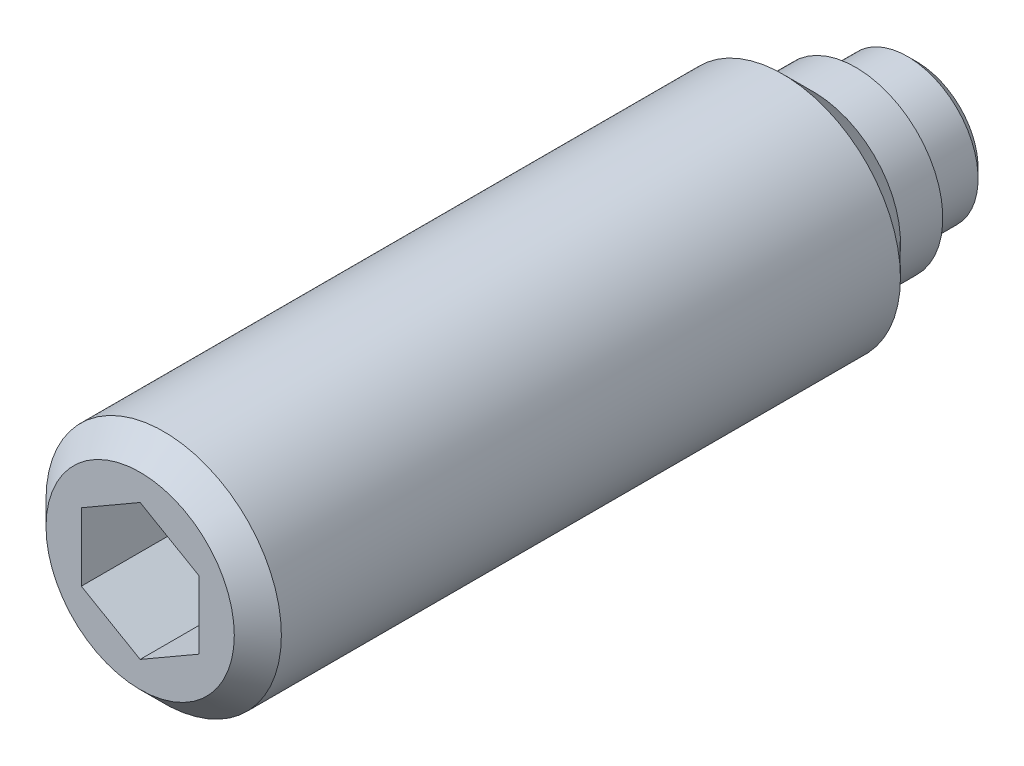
ISO-10303-21;
HEADER;
FILE_DESCRIPTION(('STEP AP214'),'2;1');
FILE_NAME('part.step','',(''),(''),'','','');
FILE_SCHEMA(('AUTOMOTIVE_DESIGN { 1 0 10303 214 1 1 1 1 }'));
ENDSEC;
DATA;
#1=APPLICATION_CONTEXT('core data for automotive mechanical design processes');
#2=APPLICATION_PROTOCOL_DEFINITION('international standard','automotive_design',2000,#1);
#3=PRODUCT_CONTEXT('',#1,'mechanical');
#4=PRODUCT('Part','Part','',(#3));
#5=PRODUCT_RELATED_PRODUCT_CATEGORY('part','',(#4));
#6=PRODUCT_DEFINITION_FORMATION('','',#4);
#7=PRODUCT_DEFINITION_CONTEXT('part definition',#1,'design');
#8=PRODUCT_DEFINITION('design','',#6,#7);
#9=PRODUCT_DEFINITION_SHAPE('','',#8);
#10=(LENGTH_UNIT() NAMED_UNIT(*) SI_UNIT(.MILLI.,.METRE.));
#11=(NAMED_UNIT(*) PLANE_ANGLE_UNIT() SI_UNIT($,.RADIAN.));
#12=(NAMED_UNIT(*) SI_UNIT($,.STERADIAN.) SOLID_ANGLE_UNIT());
#13=UNCERTAINTY_MEASURE_WITH_UNIT(LENGTH_MEASURE(1.E-05),#10,'distance_accuracy_value','');
#14=(GEOMETRIC_REPRESENTATION_CONTEXT(3) GLOBAL_UNCERTAINTY_ASSIGNED_CONTEXT((#13)) GLOBAL_UNIT_ASSIGNED_CONTEXT((#10,
#11,#12)) REPRESENTATION_CONTEXT('',''));
#15=CARTESIAN_POINT('',(0.,0.,0.));
#16=DIRECTION('',(0.,0.,1.));
#17=DIRECTION('',(1.,0.,0.));
#18=AXIS2_PLACEMENT_3D('',#15,#16,#17);
#19=CARTESIAN_POINT('',(0.,1.85,1.3));
#20=DIRECTION('',(0.,0.,1.));
#21=DIRECTION('',(1.,0.,0.));
#22=AXIS2_PLACEMENT_3D('',#19,#20,#21);
#23=PLANE('',#22);
#24=CARTESIAN_POINT('',(0.,0.,1.3));
#25=DIRECTION('',(0.,0.,-1.));
#26=DIRECTION('',(-1.,0.,0.));
#27=AXIS2_PLACEMENT_3D('',#24,#25,#26);
#28=CIRCLE('',#27,1.5);
#29=CARTESIAN_POINT('',(-1.5,0.,1.3));
#30=VERTEX_POINT('',#29);
#31=EDGE_CURVE('E130',#30,#30,#28,.T.);
#32=ORIENTED_EDGE('',*,*,#31,.F.);
#33=EDGE_LOOP('',(#32));
#34=FACE_BOUND('',#33,.T.);
#35=CARTESIAN_POINT('',(0.,0.,1.3));
#36=DIRECTION('',(0.,0.,-1.));
#37=DIRECTION('',(-1.,0.,0.));
#38=AXIS2_PLACEMENT_3D('',#35,#36,#37);
#39=CIRCLE('',#38,1.85);
#40=CARTESIAN_POINT('',(-1.85,0.,1.3));
#41=VERTEX_POINT('',#40);
#42=EDGE_CURVE('E133',#41,#41,#39,.T.);
#43=ORIENTED_EDGE('',*,*,#42,.T.);
#44=EDGE_LOOP('',(#43));
#45=FACE_BOUND('',#44,.T.);
#46=ADVANCED_FACE('F14',(#34,#45),#23,.F.);
#47=CARTESIAN_POINT('',(0.,0.,1.3));
#48=DIRECTION('',(0.,0.,-1.));
#49=DIRECTION('',(-1.,0.,0.));
#50=AXIS2_PLACEMENT_3D('',#47,#48,#49);
#51=CYLINDRICAL_SURFACE('',#50,2.5);
#52=CARTESIAN_POINT('',(0.,0.,16.));
#53=DIRECTION('',(0.,0.,1.));
#54=DIRECTION('',(1.,0.,0.));
#55=AXIS2_PLACEMENT_3D('',#52,#53,#54);
#56=CIRCLE('',#55,2.5);
#57=CARTESIAN_POINT('',(2.5,0.,16.));
#58=VERTEX_POINT('',#57);
#59=EDGE_CURVE('E9',#58,#58,#56,.F.);
#60=ORIENTED_EDGE('',*,*,#59,.T.);
#61=EDGE_LOOP('',(#60));
#62=FACE_BOUND('',#61,.T.);
#63=CARTESIAN_POINT('',(0.,0.,2.85));
#64=DIRECTION('',(0.,0.,-1.));
#65=DIRECTION('',(-1.,0.,0.));
#66=AXIS2_PLACEMENT_3D('',#63,#64,#65);
#67=CIRCLE('',#66,2.5);
#68=CARTESIAN_POINT('',(-2.5,0.,2.85));
#69=VERTEX_POINT('',#68);
#70=EDGE_CURVE('E139',#69,#69,#67,.T.);
#71=ORIENTED_EDGE('',*,*,#70,.F.);
#72=EDGE_LOOP('',(#71));
#73=FACE_BOUND('',#72,.T.);
#74=ADVANCED_FACE('F157',(#62,#73),#51,.T.);
#75=CARTESIAN_POINT('',(0.,0.,2.85));
#76=DIRECTION('',(0.,0.,1.));
#77=DIRECTION('',(1.,0.,0.));
#78=AXIS2_PLACEMENT_3D('',#75,#76,#77);
#79=CONICAL_SURFACE('',#78,2.5,0.785398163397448);
#80=CARTESIAN_POINT('',(0.,0.,2.2));
#81=DIRECTION('',(0.,0.,-1.));
#82=DIRECTION('',(-1.,0.,0.));
#83=AXIS2_PLACEMENT_3D('',#80,#81,#82);
#84=CIRCLE('',#83,1.85);
#85=CARTESIAN_POINT('',(-1.85,0.,2.2));
#86=VERTEX_POINT('',#85);
#87=EDGE_CURVE('E136',#86,#86,#84,.T.);
#88=ORIENTED_EDGE('',*,*,#87,.F.);
#89=EDGE_LOOP('',(#88));
#90=FACE_BOUND('',#89,.T.);
#91=ORIENTED_EDGE('',*,*,#70,.T.);
#92=EDGE_LOOP('',(#91));
#93=FACE_BOUND('',#92,.T.);
#94=ADVANCED_FACE('F164',(#90,#93),#79,.T.);
#95=CARTESIAN_POINT('',(0.,0.,1.3));
#96=DIRECTION('',(0.,0.,-1.));
#97=DIRECTION('',(-1.,0.,0.));
#98=AXIS2_PLACEMENT_3D('',#95,#96,#97);
#99=CYLINDRICAL_SURFACE('',#98,1.85);
#100=ORIENTED_EDGE('',*,*,#42,.F.);
#101=EDGE_LOOP('',(#100));
#102=FACE_BOUND('',#101,.T.);
#103=ORIENTED_EDGE('',*,*,#87,.T.);
#104=EDGE_LOOP('',(#103));
#105=FACE_BOUND('',#104,.T.);
#106=ADVANCED_FACE('F172',(#102,#105),#99,.T.);
#107=CARTESIAN_POINT('',(0.,0.,-0.5));
#108=DIRECTION('',(0.,0.,-1.));
#109=DIRECTION('',(-1.,0.,0.));
#110=AXIS2_PLACEMENT_3D('',#107,#108,#109);
#111=CYLINDRICAL_SURFACE('',#110,1.5);
#112=CARTESIAN_POINT('',(0.,0.,0.2));
#113=DIRECTION('',(0.,0.,-1.));
#114=DIRECTION('',(-1.,0.,0.));
#115=AXIS2_PLACEMENT_3D('',#112,#113,#114);
#116=CIRCLE('',#115,1.5);
#117=CARTESIAN_POINT('',(-1.5,0.,0.2));
#118=VERTEX_POINT('',#117);
#119=EDGE_CURVE('E127',#118,#118,#116,.T.);
#120=ORIENTED_EDGE('',*,*,#119,.F.);
#121=EDGE_LOOP('',(#120));
#122=FACE_BOUND('',#121,.T.);
#123=ORIENTED_EDGE('',*,*,#31,.T.);
#124=EDGE_LOOP('',(#123));
#125=FACE_BOUND('',#124,.T.);
#126=ADVANCED_FACE('F170',(#122,#125),#111,.T.);
#127=CARTESIAN_POINT('',(0.,0.,0.2));
#128=DIRECTION('',(0.,0.,1.));
#129=DIRECTION('',(1.,0.,0.));
#130=AXIS2_PLACEMENT_3D('',#127,#128,#129);
#131=CONICAL_SURFACE('',#130,1.5,0.785398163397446);
#132=CARTESIAN_POINT('',(0.,0.,0.));
#133=DIRECTION('',(0.,0.,-1.));
#134=DIRECTION('',(-1.,0.,0.));
#135=AXIS2_PLACEMENT_3D('',#132,#133,#134);
#136=CIRCLE('',#135,1.3);
#137=CARTESIAN_POINT('',(-1.3,0.,0.));
#138=VERTEX_POINT('',#137);
#139=EDGE_CURVE('E124',#138,#138,#136,.T.);
#140=ORIENTED_EDGE('',*,*,#139,.F.);
#141=EDGE_LOOP('',(#140));
#142=FACE_BOUND('',#141,.T.);
#143=ORIENTED_EDGE('',*,*,#119,.T.);
#144=EDGE_LOOP('',(#143));
#145=FACE_BOUND('',#144,.T.);
#146=ADVANCED_FACE('F204',(#142,#145),#131,.T.);
#147=CARTESIAN_POINT('',(0.,1.3,0.));
#148=DIRECTION('',(0.,0.,1.));
#149=DIRECTION('',(1.,0.,0.));
#150=AXIS2_PLACEMENT_3D('',#147,#148,#149);
#151=PLANE('',#150);
#152=CARTESIAN_POINT('',(0.,0.,0.));
#153=DIRECTION('',(0.,0.,-1.));
#154=DIRECTION('',(-1.,0.,0.));
#155=AXIS2_PLACEMENT_3D('',#152,#153,#154);
#156=CIRCLE('',#155,0.5);
#157=CARTESIAN_POINT('',(-0.5,0.,0.));
#158=VERTEX_POINT('',#157);
#159=EDGE_CURVE('E114',#158,#158,#156,.T.);
#160=ORIENTED_EDGE('',*,*,#159,.F.);
#161=EDGE_LOOP('',(#160));
#162=FACE_BOUND('',#161,.T.);
#163=ORIENTED_EDGE('',*,*,#139,.T.);
#164=EDGE_LOOP('',(#163));
#165=FACE_BOUND('',#164,.T.);
#166=ADVANCED_FACE('F212',(#162,#165),#151,.F.);
#167=CARTESIAN_POINT('',(0.,0.,0.));
#168=DIRECTION('',(0.,0.,1.));
#169=DIRECTION('',(1.,0.,0.));
#170=AXIS2_PLACEMENT_3D('',#167,#168,#169);
#171=CONICAL_SURFACE('',#170,0.5,0.785398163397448);
#172=CARTESIAN_POINT('',(0.,0.,-0.5));
#173=VERTEX_POINT('',#172);
#174=VERTEX_LOOP('',#173);
#175=FACE_BOUND('',#174,.T.);
#176=ORIENTED_EDGE('',*,*,#159,.T.);
#177=EDGE_LOOP('',(#176));
#178=FACE_BOUND('',#177,.T.);
#179=ADVANCED_FACE('F220',(#175,#178),#171,.T.);
#180=CARTESIAN_POINT('',(0.,0.,16.5));
#181=DIRECTION('',(0.,0.,1.));
#182=DIRECTION('',(1.,0.,0.));
#183=AXIS2_PLACEMENT_3D('',#180,#181,#182);
#184=PLANE('',#183);
#185=CARTESIAN_POINT('',(0.,0.,16.5));
#186=DIRECTION('',(0.,0.,1.));
#187=DIRECTION('',(1.,0.,0.));
#188=AXIS2_PLACEMENT_3D('',#185,#186,#187);
#189=CIRCLE('',#188,2.);
#190=CARTESIAN_POINT('',(2.,0.,16.5));
#191=VERTEX_POINT('',#190);
#192=EDGE_CURVE('E22',#191,#191,#189,.T.);
#193=ORIENTED_EDGE('',*,*,#192,.T.);
#194=EDGE_LOOP('',(#193));
#195=FACE_BOUND('',#194,.T.);
#196=DIRECTION('',(-0.866025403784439,0.5,0.));
#197=VECTOR('',#196,1.);
#198=CARTESIAN_POINT('',(1.25,0.721687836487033,16.5));
#199=LINE('',#198,#197);
#200=CARTESIAN_POINT('',(1.25,0.721687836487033,16.5));
#201=VERTEX_POINT('',#200);
#202=CARTESIAN_POINT('',(0.,1.44337567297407,16.5));
#203=VERTEX_POINT('',#202);
#204=EDGE_CURVE('E29',#201,#203,#199,.T.);
#205=ORIENTED_EDGE('',*,*,#204,.F.);
#206=DIRECTION('',(0.,1.,0.));
#207=VECTOR('',#206,1.);
#208=CARTESIAN_POINT('',(1.25,-0.721687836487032,16.5));
#209=LINE('',#208,#207);
#210=CARTESIAN_POINT('',(1.25,-0.721687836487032,16.5));
#211=VERTEX_POINT('',#210);
#212=EDGE_CURVE('E88',#211,#201,#209,.T.);
#213=ORIENTED_EDGE('',*,*,#212,.F.);
#214=DIRECTION('',(0.866025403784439,0.5,0.));
#215=VECTOR('',#214,1.);
#216=CARTESIAN_POINT('',(0.,-1.44337567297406,16.5));
#217=LINE('',#216,#215);
#218=CARTESIAN_POINT('',(0.,-1.44337567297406,16.5));
#219=VERTEX_POINT('',#218);
#220=EDGE_CURVE('E91',#219,#211,#217,.T.);
#221=ORIENTED_EDGE('',*,*,#220,.F.);
#222=DIRECTION('',(0.866025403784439,-0.5,0.));
#223=VECTOR('',#222,1.);
#224=CARTESIAN_POINT('',(-1.25,-0.721687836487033,16.5));
#225=LINE('',#224,#223);
#226=CARTESIAN_POINT('',(-1.25,-0.721687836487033,16.5));
#227=VERTEX_POINT('',#226);
#228=EDGE_CURVE('E107',#227,#219,#225,.T.);
#229=ORIENTED_EDGE('',*,*,#228,.F.);
#230=DIRECTION('',(0.,-1.,0.));
#231=VECTOR('',#230,1.);
#232=CARTESIAN_POINT('',(-1.25,0.721687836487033,16.5));
#233=LINE('',#232,#231);
#234=CARTESIAN_POINT('',(-1.25,0.721687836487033,16.5));
#235=VERTEX_POINT('',#234);
#236=EDGE_CURVE('E104',#235,#227,#233,.T.);
#237=ORIENTED_EDGE('',*,*,#236,.F.);
#238=DIRECTION('',(-0.866025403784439,-0.5,0.));
#239=VECTOR('',#238,1.);
#240=CARTESIAN_POINT('',(0.,1.44337567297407,16.5));
#241=LINE('',#240,#239);
#242=EDGE_CURVE('E102',#203,#235,#241,.T.);
#243=ORIENTED_EDGE('',*,*,#242,.F.);
#244=EDGE_LOOP('',(#205,#213,#221,#229,#237,#243));
#245=FACE_BOUND('',#244,.T.);
#246=ADVANCED_FACE('F144',(#195,#245),#184,.T.);
#247=CARTESIAN_POINT('',(1.25,0.721687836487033,13.5));
#248=DIRECTION('',(0.5,0.866025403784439,0.));
#249=DIRECTION('',(-0.866025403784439,0.5,0.));
#250=AXIS2_PLACEMENT_3D('',#247,#248,#249);
#251=PLANE('',#250);
#252=ORIENTED_EDGE('',*,*,#204,.T.);
#253=DIRECTION('',(0.,0.,1.));
#254=VECTOR('',#253,1.);
#255=CARTESIAN_POINT('',(0.,1.44337567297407,13.5));
#256=LINE('',#255,#254);
#257=CARTESIAN_POINT('',(0.,1.44337567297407,13.5));
#258=VERTEX_POINT('',#257);
#259=EDGE_CURVE('E65',#258,#203,#256,.T.);
#260=ORIENTED_EDGE('',*,*,#259,.F.);
#261=DIRECTION('',(-0.866025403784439,0.5,0.));
#262=VECTOR('',#261,1.);
#263=CARTESIAN_POINT('',(1.25,0.721687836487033,13.5));
#264=LINE('',#263,#262);
#265=CARTESIAN_POINT('',(1.25,0.721687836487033,13.5));
#266=VERTEX_POINT('',#265);
#267=EDGE_CURVE('E69',#266,#258,#264,.T.);
#268=ORIENTED_EDGE('',*,*,#267,.F.);
#269=DIRECTION('',(0.,0.,1.));
#270=VECTOR('',#269,1.);
#271=CARTESIAN_POINT('',(1.25,0.721687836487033,13.5));
#272=LINE('',#271,#270);
#273=EDGE_CURVE('E112',#266,#201,#272,.T.);
#274=ORIENTED_EDGE('',*,*,#273,.T.);
#275=EDGE_LOOP('',(#252,#260,#268,#274));
#276=FACE_BOUND('',#275,.T.);
#277=ADVANCED_FACE('F67',(#276),#251,.F.);
#278=CARTESIAN_POINT('',(1.25,-0.721687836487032,13.5));
#279=DIRECTION('',(1.,0.,0.));
#280=DIRECTION('',(0.,0.,-1.));
#281=AXIS2_PLACEMENT_3D('',#278,#279,#280);
#282=PLANE('',#281);
#283=ORIENTED_EDGE('',*,*,#212,.T.);
#284=ORIENTED_EDGE('',*,*,#273,.F.);
#285=DIRECTION('',(0.,1.,0.));
#286=VECTOR('',#285,1.);
#287=CARTESIAN_POINT('',(1.25,-0.721687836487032,13.5));
#288=LINE('',#287,#286);
#289=CARTESIAN_POINT('',(1.25,-0.721687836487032,13.5));
#290=VERTEX_POINT('',#289);
#291=EDGE_CURVE('E75',#290,#266,#288,.T.);
#292=ORIENTED_EDGE('',*,*,#291,.F.);
#293=DIRECTION('',(0.,0.,1.));
#294=VECTOR('',#293,1.);
#295=CARTESIAN_POINT('',(1.25,-0.721687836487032,13.5));
#296=LINE('',#295,#294);
#297=EDGE_CURVE('E115',#290,#211,#296,.T.);
#298=ORIENTED_EDGE('',*,*,#297,.T.);
#299=EDGE_LOOP('',(#283,#284,#292,#298));
#300=FACE_BOUND('',#299,.T.);
#301=ADVANCED_FACE('F243',(#300),#282,.F.);
#302=CARTESIAN_POINT('',(0.,-1.44337567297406,13.5));
#303=DIRECTION('',(0.5,-0.866025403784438,0.));
#304=DIRECTION('',(0.866025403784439,0.5,0.));
#305=AXIS2_PLACEMENT_3D('',#302,#303,#304);
#306=PLANE('',#305);
#307=ORIENTED_EDGE('',*,*,#220,.T.);
#308=ORIENTED_EDGE('',*,*,#297,.F.);
#309=DIRECTION('',(0.866025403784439,0.5,0.));
#310=VECTOR('',#309,1.);
#311=CARTESIAN_POINT('',(0.,-1.44337567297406,13.5));
#312=LINE('',#311,#310);
#313=CARTESIAN_POINT('',(0.,-1.44337567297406,13.5));
#314=VERTEX_POINT('',#313);
#315=EDGE_CURVE('E98',#314,#290,#312,.T.);
#316=ORIENTED_EDGE('',*,*,#315,.F.);
#317=DIRECTION('',(0.,0.,1.));
#318=VECTOR('',#317,1.);
#319=CARTESIAN_POINT('',(0.,-1.44337567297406,13.5));
#320=LINE('',#319,#318);
#321=EDGE_CURVE('E117',#314,#219,#320,.T.);
#322=ORIENTED_EDGE('',*,*,#321,.T.);
#323=EDGE_LOOP('',(#307,#308,#316,#322));
#324=FACE_BOUND('',#323,.T.);
#325=ADVANCED_FACE('F251',(#324),#306,.F.);
#326=CARTESIAN_POINT('',(-1.25,-0.721687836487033,13.5));
#327=DIRECTION('',(-0.5,-0.866025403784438,0.));
#328=DIRECTION('',(0.866025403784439,-0.5,0.));
#329=AXIS2_PLACEMENT_3D('',#326,#327,#328);
#330=PLANE('',#329);
#331=ORIENTED_EDGE('',*,*,#228,.T.);
#332=ORIENTED_EDGE('',*,*,#321,.F.);
#333=DIRECTION('',(0.866025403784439,-0.5,0.));
#334=VECTOR('',#333,1.);
#335=CARTESIAN_POINT('',(-1.25,-0.721687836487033,13.5));
#336=LINE('',#335,#334);
#337=CARTESIAN_POINT('',(-1.25,-0.721687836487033,13.5));
#338=VERTEX_POINT('',#337);
#339=EDGE_CURVE('E95',#338,#314,#336,.T.);
#340=ORIENTED_EDGE('',*,*,#339,.F.);
#341=DIRECTION('',(0.,0.,1.));
#342=VECTOR('',#341,1.);
#343=CARTESIAN_POINT('',(-1.25,-0.721687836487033,13.5));
#344=LINE('',#343,#342);
#345=EDGE_CURVE('E119',#338,#227,#344,.T.);
#346=ORIENTED_EDGE('',*,*,#345,.T.);
#347=EDGE_LOOP('',(#331,#332,#340,#346));
#348=FACE_BOUND('',#347,.T.);
#349=ADVANCED_FACE('F260',(#348),#330,.F.);
#350=CARTESIAN_POINT('',(-1.25,0.721687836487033,13.5));
#351=DIRECTION('',(-1.,0.,0.));
#352=DIRECTION('',(0.,-1.,0.));
#353=AXIS2_PLACEMENT_3D('',#350,#351,#352);
#354=PLANE('',#353);
#355=ORIENTED_EDGE('',*,*,#236,.T.);
#356=ORIENTED_EDGE('',*,*,#345,.F.);
#357=DIRECTION('',(0.,-1.,0.));
#358=VECTOR('',#357,1.);
#359=CARTESIAN_POINT('',(-1.25,0.721687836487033,13.5));
#360=LINE('',#359,#358);
#361=CARTESIAN_POINT('',(-1.25,0.721687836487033,13.5));
#362=VERTEX_POINT('',#361);
#363=EDGE_CURVE('E83',#362,#338,#360,.T.);
#364=ORIENTED_EDGE('',*,*,#363,.F.);
#365=DIRECTION('',(0.,0.,1.));
#366=VECTOR('',#365,1.);
#367=CARTESIAN_POINT('',(-1.25,0.721687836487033,13.5));
#368=LINE('',#367,#366);
#369=EDGE_CURVE('E74',#362,#235,#368,.T.);
#370=ORIENTED_EDGE('',*,*,#369,.T.);
#371=EDGE_LOOP('',(#355,#356,#364,#370));
#372=FACE_BOUND('',#371,.T.);
#373=ADVANCED_FACE('F269',(#372),#354,.F.);
#374=CARTESIAN_POINT('',(0.,1.44337567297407,13.5));
#375=DIRECTION('',(-0.5,0.866025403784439,0.));
#376=DIRECTION('',(-0.866025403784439,-0.5,0.));
#377=AXIS2_PLACEMENT_3D('',#374,#375,#376);
#378=PLANE('',#377);
#379=ORIENTED_EDGE('',*,*,#242,.T.);
#380=ORIENTED_EDGE('',*,*,#369,.F.);
#381=DIRECTION('',(-0.866025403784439,-0.5,0.));
#382=VECTOR('',#381,1.);
#383=CARTESIAN_POINT('',(0.,1.44337567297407,13.5));
#384=LINE('',#383,#382);
#385=EDGE_CURVE('E78',#258,#362,#384,.T.);
#386=ORIENTED_EDGE('',*,*,#385,.F.);
#387=ORIENTED_EDGE('',*,*,#259,.T.);
#388=EDGE_LOOP('',(#379,#380,#386,#387));
#389=FACE_BOUND('',#388,.T.);
#390=ADVANCED_FACE('F79',(#389),#378,.F.);
#391=CARTESIAN_POINT('',(0.,0.,13.5));
#392=DIRECTION('',(0.,0.,1.));
#393=DIRECTION('',(1.,0.,0.));
#394=AXIS2_PLACEMENT_3D('',#391,#392,#393);
#395=PLANE('',#394);
#396=ORIENTED_EDGE('',*,*,#267,.T.);
#397=ORIENTED_EDGE('',*,*,#385,.T.);
#398=ORIENTED_EDGE('',*,*,#363,.T.);
#399=ORIENTED_EDGE('',*,*,#339,.T.);
#400=ORIENTED_EDGE('',*,*,#315,.T.);
#401=ORIENTED_EDGE('',*,*,#291,.T.);
#402=EDGE_LOOP('',(#396,#397,#398,#399,#400,#401));
#403=FACE_BOUND('',#402,.T.);
#404=ADVANCED_FACE('F85',(#403),#395,.T.);
#405=CARTESIAN_POINT('',(0.,0.,16.5));
#406=DIRECTION('',(0.,0.,-1.));
#407=DIRECTION('',(-1.,0.,0.));
#408=AXIS2_PLACEMENT_3D('',#405,#406,#407);
#409=CONICAL_SURFACE('',#408,2.,0.78539816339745);
#410=ORIENTED_EDGE('',*,*,#59,.F.);
#411=EDGE_LOOP('',(#410));
#412=FACE_BOUND('',#411,.T.);
#413=ORIENTED_EDGE('',*,*,#192,.F.);
#414=EDGE_LOOP('',(#413));
#415=FACE_BOUND('',#414,.T.);
#416=ADVANCED_FACE('F16',(#412,#415),#409,.T.);
#417=CLOSED_SHELL('',(#46,#74,#94,#106,#126,#146,#166,#179,#246,#277,#301,#325,#349,#373,#390,
#404,#416));
#418=MANIFOLD_SOLID_BREP('B1',#417);
#419=ADVANCED_BREP_SHAPE_REPRESENTATION('',(#18,#418),#14);
#420=SHAPE_DEFINITION_REPRESENTATION(#9,#419);
ENDSEC;
END-ISO-10303-21;
